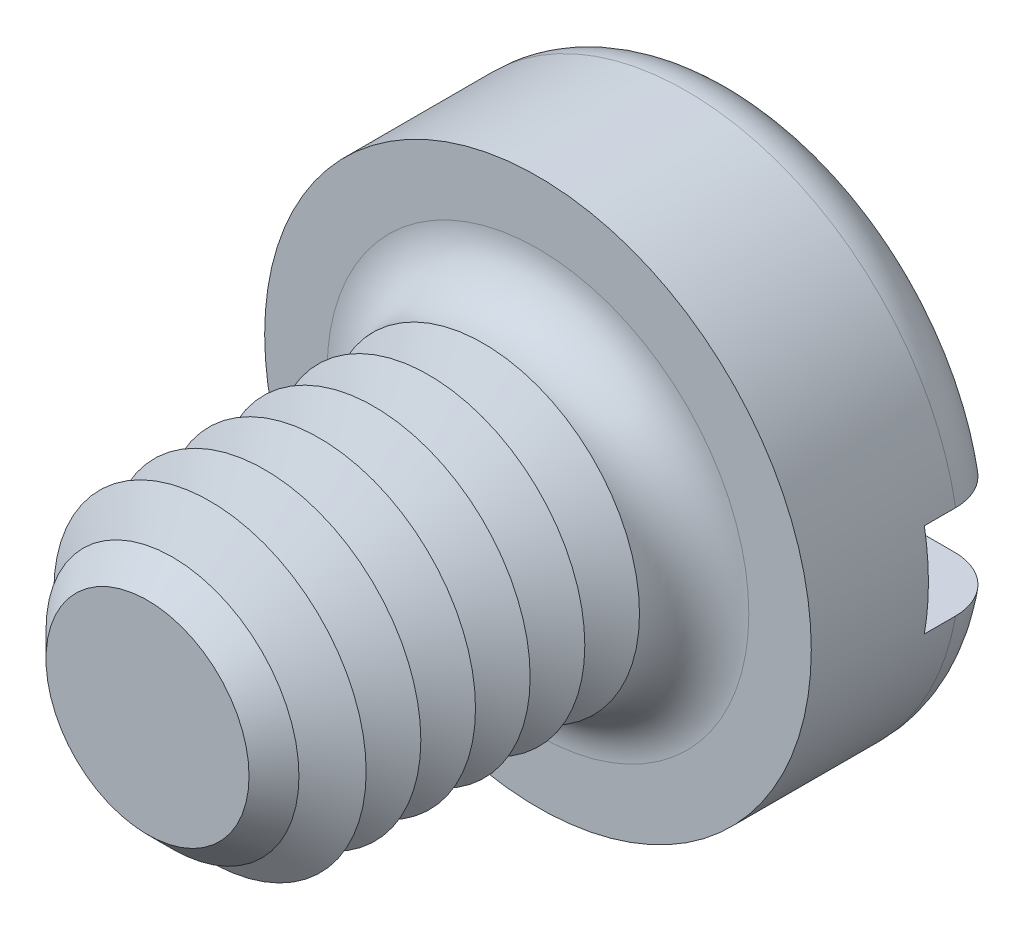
ISO-10303-21;
HEADER;
FILE_DESCRIPTION(('STEP AP214'),'2;1');
FILE_NAME('part.step','',(''),(''),'','','');
FILE_SCHEMA(('AUTOMOTIVE_DESIGN { 1 0 10303 214 1 1 1 1 }'));
ENDSEC;
DATA;
#1=APPLICATION_CONTEXT('core data for automotive mechanical design processes');
#2=APPLICATION_PROTOCOL_DEFINITION('international standard','automotive_design',2000,#1);
#3=PRODUCT_CONTEXT('',#1,'mechanical');
#4=PRODUCT('Part','Part','',(#3));
#5=PRODUCT_RELATED_PRODUCT_CATEGORY('part','',(#4));
#6=PRODUCT_DEFINITION_FORMATION('','',#4);
#7=PRODUCT_DEFINITION_CONTEXT('part definition',#1,'design');
#8=PRODUCT_DEFINITION('design','',#6,#7);
#9=PRODUCT_DEFINITION_SHAPE('','',#8);
#10=(LENGTH_UNIT() NAMED_UNIT(*) SI_UNIT(.MILLI.,.METRE.));
#11=(NAMED_UNIT(*) PLANE_ANGLE_UNIT() SI_UNIT($,.RADIAN.));
#12=(NAMED_UNIT(*) SI_UNIT($,.STERADIAN.) SOLID_ANGLE_UNIT());
#13=UNCERTAINTY_MEASURE_WITH_UNIT(LENGTH_MEASURE(1.E-05),#10,'distance_accuracy_value','');
#14=(GEOMETRIC_REPRESENTATION_CONTEXT(3) GLOBAL_UNCERTAINTY_ASSIGNED_CONTEXT((#13)) GLOBAL_UNIT_ASSIGNED_CONTEXT((#10,
#11,#12)) REPRESENTATION_CONTEXT('',''));
#15=CARTESIAN_POINT('',(0.,0.,0.));
#16=DIRECTION('',(0.,0.,1.));
#17=DIRECTION('',(1.,0.,0.));
#18=AXIS2_PLACEMENT_3D('',#15,#16,#17);
#19=CARTESIAN_POINT('',(0.,0.,-2.6));
#20=DIRECTION('',(0.,0.,1.));
#21=DIRECTION('',(1.,0.,0.));
#22=AXIS2_PLACEMENT_3D('',#19,#20,#21);
#23=PLANE('',#22);
#24=CARTESIAN_POINT('',(0.,0.,-2.6));
#25=DIRECTION('',(0.,0.,1.));
#26=DIRECTION('',(1.,0.,0.));
#27=AXIS2_PLACEMENT_3D('',#24,#25,#26);
#28=CIRCLE('',#27,2.8);
#29=CARTESIAN_POINT('',(-2.73495886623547,0.6,-2.6));
#30=VERTEX_POINT('',#29);
#31=CARTESIAN_POINT('',(2.73495886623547,0.6,-2.6));
#32=VERTEX_POINT('',#31);
#33=EDGE_CURVE('E116',#30,#32,#28,.F.);
#34=ORIENTED_EDGE('',*,*,#33,.T.);
#35=DIRECTION('',(1.,0.,0.));
#36=VECTOR('',#35,1.);
#37=CARTESIAN_POINT('',(-3.5,0.600000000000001,-2.6));
#38=LINE('',#37,#36);
#39=EDGE_CURVE('E111',#30,#32,#38,.T.);
#40=ORIENTED_EDGE('',*,*,#39,.F.);
#41=EDGE_LOOP('',(#34,#40));
#42=FACE_BOUND('',#41,.T.);
#43=ADVANCED_FACE('F39',(#42),#23,.F.);
#44=CARTESIAN_POINT('',(0.,0.,-1.9));
#45=DIRECTION('',(0.,0.,1.));
#46=DIRECTION('',(1.,0.,0.));
#47=AXIS2_PLACEMENT_3D('',#44,#45,#46);
#48=TOROIDAL_SURFACE('',#47,2.8,0.7);
#49=CARTESIAN_POINT('',(-3.24550494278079,0.600000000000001,-2.38938679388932));
#50=CARTESIAN_POINT('',(-3.21724139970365,0.600000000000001,-2.41780774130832));
#51=CARTESIAN_POINT('',(-3.18652103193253,0.600000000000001,-2.44383169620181));
#52=CARTESIAN_POINT('',(-3.12110229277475,0.600000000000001,-2.49034599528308));
#53=CARTESIAN_POINT('',(-3.08639834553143,0.6,-2.51082844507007));
#54=CARTESIAN_POINT('',(-3.01410013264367,0.6,-2.54568075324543));
#55=CARTESIAN_POINT('',(-2.97650963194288,0.6,-2.56005841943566));
#56=CARTESIAN_POINT('',(-2.89948250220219,0.6,-2.58239238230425));
#57=CARTESIAN_POINT('',(-2.86004633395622,0.6,-2.59035027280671));
#58=CARTESIAN_POINT('',(-2.77983715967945,0.6,-2.5997577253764));
#59=CARTESIAN_POINT('',(-2.73905311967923,0.6,-2.60111317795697));
#60=CARTESIAN_POINT('',(-2.65781876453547,0.6,-2.59706866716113));
#61=CARTESIAN_POINT('',(-2.61736849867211,0.6,-2.59166772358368));
#62=CARTESIAN_POINT('',(-2.53729983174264,0.6,-2.57414594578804));
#63=CARTESIAN_POINT('',(-2.49770360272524,0.6,-2.56192363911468));
#64=CARTESIAN_POINT('',(-2.421111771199,0.6,-2.5310238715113));
#65=CARTESIAN_POINT('',(-2.38411632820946,0.6,-2.51234601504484));
#66=CARTESIAN_POINT('',(-2.31371213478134,0.6,-2.46896762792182));
#67=CARTESIAN_POINT('',(-2.28031240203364,0.6,-2.44425244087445));
#68=CARTESIAN_POINT('',(-2.21823311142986,0.6,-2.38946667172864));
#69=CARTESIAN_POINT('',(-2.18955321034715,0.6,-2.35939647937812));
#70=CARTESIAN_POINT('',(-2.13836074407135,0.6,-2.29532787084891));
#71=CARTESIAN_POINT('',(-2.11574147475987,0.6,-2.26141482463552));
#72=CARTESIAN_POINT('',(-2.07677080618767,0.6,-2.19015935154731));
#73=CARTESIAN_POINT('',(-2.06041784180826,0.6,-2.15281778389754));
#74=CARTESIAN_POINT('',(-2.03508596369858,0.6,-2.07723332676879));
#75=CARTESIAN_POINT('',(-2.02585871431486,0.6,-2.03907365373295));
#76=CARTESIAN_POINT('',(-2.01416722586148,0.6,-1.96173417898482));
#77=CARTESIAN_POINT('',(-2.01170151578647,0.6,-1.92255460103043));
#78=CARTESIAN_POINT('',(-2.01359934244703,0.6,-1.84555709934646));
#79=CARTESIAN_POINT('',(-2.01775787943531,0.6,-1.80773393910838));
#80=CARTESIAN_POINT('',(-2.03236373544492,0.6,-1.73332511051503));
#81=CARTESIAN_POINT('',(-2.04281097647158,0.6,-1.69673942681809));
#82=CARTESIAN_POINT('',(-2.06962963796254,0.6,-1.62577336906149));
#83=CARTESIAN_POINT('',(-2.08600685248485,0.6,-1.59139519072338));
#84=CARTESIAN_POINT('',(-2.12413495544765,0.6,-1.52576356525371));
#85=CARTESIAN_POINT('',(-2.14588657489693,0.6,-1.49451054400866));
#86=CARTESIAN_POINT('',(-2.19483541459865,0.6,-1.43498643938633));
#87=CARTESIAN_POINT('',(-2.22217844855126,0.6,-1.40683532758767));
#88=CARTESIAN_POINT('',(-2.28105616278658,0.6,-1.35532544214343));
#89=CARTESIAN_POINT('',(-2.3125916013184,0.6,-1.33196753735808));
#90=CARTESIAN_POINT('',(-2.38018779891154,0.6,-1.28984356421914));
#91=CARTESIAN_POINT('',(-2.41637068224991,0.6,-1.27127330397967));
#92=CARTESIAN_POINT('',(-2.49129688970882,0.6,-1.24032971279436));
#93=CARTESIAN_POINT('',(-2.53004053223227,0.6,-1.22795715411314));
#94=CARTESIAN_POINT('',(-2.6098393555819,0.6,-1.2095515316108));
#95=CARTESIAN_POINT('',(-2.65092550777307,0.6,-1.20365237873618));
#96=CARTESIAN_POINT('',(-2.7335069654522,0.6,-1.1988380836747));
#97=CARTESIAN_POINT('',(-2.7750022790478,0.6,-1.19992308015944));
#98=CARTESIAN_POINT('',(-2.85718851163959,0.6,-1.20909046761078));
#99=CARTESIAN_POINT('',(-2.8978799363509,0.6,-1.21716830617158));
#100=CARTESIAN_POINT('',(-2.97729176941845,0.6,-1.24014327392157));
#101=CARTESIAN_POINT('',(-3.01601231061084,0.6,-1.25503994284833));
#102=CARTESIAN_POINT('',(-3.08976822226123,0.6,-1.29101066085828));
#103=CARTESIAN_POINT('',(-3.12484927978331,0.600000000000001,-1.31199098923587));
#104=CARTESIAN_POINT('',(-3.19090022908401,0.600000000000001,-1.35965144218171));
#105=CARTESIAN_POINT('',(-3.22187053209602,0.600000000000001,-1.38633099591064));
#106=CARTESIAN_POINT('',(-3.2781946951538,0.600000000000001,-1.44408564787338));
#107=CARTESIAN_POINT('',(-3.3036441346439,0.600000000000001,-1.47506754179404));
#108=CARTESIAN_POINT('',(-3.34887649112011,0.600000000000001,-1.54092398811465));
#109=CARTESIAN_POINT('',(-3.36865993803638,0.600000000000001,-1.57579817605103));
#110=CARTESIAN_POINT('',(-3.40166738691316,0.600000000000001,-1.64783067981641));
#111=CARTESIAN_POINT('',(-3.41499360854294,0.600000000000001,-1.68494217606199));
#112=CARTESIAN_POINT('',(-3.43515375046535,0.600000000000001,-1.76088675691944));
#113=CARTESIAN_POINT('',(-3.44198836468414,0.600000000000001,-1.79971965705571));
#114=CARTESIAN_POINT('',(-3.44891916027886,0.600000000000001,-1.87757893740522));
#115=CARTESIAN_POINT('',(-3.44908375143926,0.600000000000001,-1.91659924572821));
#116=CARTESIAN_POINT('',(-3.44284111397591,0.600000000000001,-1.99412088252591));
#117=CARTESIAN_POINT('',(-3.43643236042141,0.600000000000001,-2.03262208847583));
#118=CARTESIAN_POINT('',(-3.41725803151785,0.600000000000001,-2.10792315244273));
#119=CARTESIAN_POINT('',(-3.40450469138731,0.600000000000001,-2.14472613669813));
#120=CARTESIAN_POINT('',(-3.3730385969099,0.600000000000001,-2.21565060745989));
#121=CARTESIAN_POINT('',(-3.35433321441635,0.600000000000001,-2.24977534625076));
#122=CARTESIAN_POINT('',(-3.3201892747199,0.600000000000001,-2.30136364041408));
#123=CARTESIAN_POINT('',(-3.30647805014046,0.600000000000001,-2.31999402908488));
#124=CARTESIAN_POINT('',(-3.27728518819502,0.600000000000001,-2.35581090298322));
#125=CARTESIAN_POINT('',(-3.26180356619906,0.600000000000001,-2.37299740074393));
#126=CARTESIAN_POINT('',(-3.24550494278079,0.600000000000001,-2.38938679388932));
#127=B_SPLINE_CURVE_WITH_KNOTS('',3,(#49,#50,#51,#52,#53,#54,#55,#56,#57,#58,#59,#60,#61,#62,
#63,#64,#65,#66,#67,#68,#69,#70,#71,#72,#73,#74,#75,#76,#77,#78,#79,#80,#81,#82,#83,#84,#85,#86,
#87,#88,#89,#90,#91,#92,#93,#94,#95,#96,#97,#98,#99,#100,#101,#102,#103,#104,#105,#106,#107,
#108,#109,#110,#111,#112,#113,#114,#115,#116,#117,#118,#119,#120,#121,#122,#123,#124,#125,#126),
.UNSPECIFIED.,.T.,.F.,(4,2,2,2,2,2,2,2,2,2,2,2,2,2,2,2,2,2,2,2,2,2,2,2,2,2,2,2,2,2,2,2,2,2,2,2,
2,2,4),(0.,0.120160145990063,0.240490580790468,0.36066665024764,0.480812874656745,
0.602666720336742,0.724538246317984,0.848272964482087,0.972015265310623,1.09606100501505,
1.2200977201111,1.34178071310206,1.46343329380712,1.58062647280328,1.6977941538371,
1.81140573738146,1.92501591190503,2.03873739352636,2.15247435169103,2.26967910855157,
2.38690509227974,2.50835551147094,2.62982106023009,2.75375450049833,2.87769040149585,
3.00154567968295,3.12539259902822,3.24742469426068,3.36944457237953,3.48914477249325,
3.60883377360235,3.72656056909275,3.84427477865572,3.96078136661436,4.07731498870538,
4.19362474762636,4.3097910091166,4.37908387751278,4.44837614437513),.UNSPECIFIED.);
#128=CARTESIAN_POINT('',(-3.44818792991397,0.600000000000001,-1.8999999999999));
#129=VERTEX_POINT('',#128);
#130=EDGE_CURVE('E232',#129,#30,#127,.T.);
#131=ORIENTED_EDGE('',*,*,#130,.F.);
#132=CARTESIAN_POINT('',(0.,0.,-1.9));
#133=DIRECTION('',(0.,0.,1.));
#134=DIRECTION('',(1.,0.,0.));
#135=AXIS2_PLACEMENT_3D('',#132,#133,#134);
#136=CIRCLE('',#135,3.5);
#137=CARTESIAN_POINT('',(3.44818792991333,0.6,-1.9));
#138=VERTEX_POINT('',#137);
#139=EDGE_CURVE('E125',#138,#129,#136,.T.);
#140=ORIENTED_EDGE('',*,*,#139,.F.);
#141=CARTESIAN_POINT('',(2.1414268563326,0.6,-2.29762171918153));
#142=CARTESIAN_POINT('',(2.16505443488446,0.6,-2.33058245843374));
#143=CARTESIAN_POINT('',(2.19155609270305,0.6,-2.36152717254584));
#144=CARTESIAN_POINT('',(2.24942944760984,0.6,-2.41852964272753));
#145=CARTESIAN_POINT('',(2.28080921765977,0.6,-2.44457913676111));
#146=CARTESIAN_POINT('',(2.34741203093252,0.6,-2.49105381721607));
#147=CARTESIAN_POINT('',(2.38262862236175,0.6,-2.51148824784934));
#148=CARTESIAN_POINT('',(2.45593176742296,0.6,-2.54626881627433));
#149=CARTESIAN_POINT('',(2.49401741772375,0.6,-2.56061686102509));
#150=CARTESIAN_POINT('',(2.57272605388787,0.6,-2.58306429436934));
#151=CARTESIAN_POINT('',(2.6133821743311,0.6,-2.59104769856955));
#152=CARTESIAN_POINT('',(2.6954618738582,0.6,-2.60009608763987));
#153=CARTESIAN_POINT('',(2.73688552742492,0.6,-2.60116039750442));
#154=CARTESIAN_POINT('',(2.81941950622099,0.6,-2.5962925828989));
#155=CARTESIAN_POINT('',(2.86052888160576,0.6,-2.59034422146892));
#156=CARTESIAN_POINT('',(2.94113709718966,0.6,-2.57153687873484));
#157=CARTESIAN_POINT('',(2.98063603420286,0.6,-2.55867831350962));
#158=CARTESIAN_POINT('',(3.05633735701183,0.6,-2.52657771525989));
#159=CARTESIAN_POINT('',(3.09257627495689,0.6,-2.50742188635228));
#160=CARTESIAN_POINT('',(3.16123898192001,0.6,-2.46318606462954));
#161=CARTESIAN_POINT('',(3.19366316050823,0.6,-2.4381066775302));
#162=CARTESIAN_POINT('',(3.25312278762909,0.6,-2.38324481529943));
#163=CARTESIAN_POINT('',(3.28024842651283,0.6,-2.35356008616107));
#164=CARTESIAN_POINT('',(3.32902587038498,0.6,-2.28998971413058));
#165=CARTESIAN_POINT('',(3.35067820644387,0.6,-2.25610447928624));
#166=CARTESIAN_POINT('',(3.38751207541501,0.6,-2.18572286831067));
#167=CARTESIAN_POINT('',(3.40279804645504,0.6,-2.14928112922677));
#168=CARTESIAN_POINT('',(3.42695590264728,0.6,-2.07433042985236));
#169=CARTESIAN_POINT('',(3.43582824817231,0.6,-2.03582161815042));
#170=CARTESIAN_POINT('',(3.44682113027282,0.6,-1.95829536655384));
#171=CARTESIAN_POINT('',(3.44901648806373,0.6,-1.91928851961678));
#172=CARTESIAN_POINT('',(3.44680085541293,0.6,-1.84146366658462));
#173=CARTESIAN_POINT('',(3.44239008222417,0.6,-1.80264565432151));
#174=CARTESIAN_POINT('',(3.42712544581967,0.6,-1.72644634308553));
#175=CARTESIAN_POINT('',(3.41629508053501,0.6,-1.6890603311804));
#176=CARTESIAN_POINT('',(3.38853757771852,0.6,-1.61662604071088));
#177=CARTESIAN_POINT('',(3.37161039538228,0.6,-1.58157777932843));
#178=CARTESIAN_POINT('',(3.33207798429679,0.6,-1.51464178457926));
#179=CARTESIAN_POINT('',(3.30944854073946,0.6,-1.48276835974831));
#180=CARTESIAN_POINT('',(3.2592165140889,0.6,-1.42321861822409));
#181=CARTESIAN_POINT('',(3.23161370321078,0.6,-1.3955424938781));
#182=CARTESIAN_POINT('',(3.17188519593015,0.6,-1.34481834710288));
#183=CARTESIAN_POINT('',(3.13971065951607,0.6,-1.32182785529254));
#184=CARTESIAN_POINT('',(3.07201123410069,0.6,-1.28147003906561));
#185=CARTESIAN_POINT('',(3.03648608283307,0.6,-1.26410315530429));
#186=CARTESIAN_POINT('',(2.962449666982,0.6,-1.2351645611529));
#187=CARTESIAN_POINT('',(2.92389781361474,0.6,-1.22369671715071));
#188=CARTESIAN_POINT('',(2.84543273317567,0.6,-1.20726565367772));
#189=CARTESIAN_POINT('',(2.80551936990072,0.6,-1.20230308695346));
#190=CARTESIAN_POINT('',(2.72467191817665,0.6,-1.1989357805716));
#191=CARTESIAN_POINT('',(2.68373266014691,0.6,-1.20065484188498));
#192=CARTESIAN_POINT('',(2.60270222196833,0.6,-1.21084560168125));
#193=CARTESIAN_POINT('',(2.56261112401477,0.6,-1.21931795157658));
#194=CARTESIAN_POINT('',(2.48385954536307,0.6,-1.24292934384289));
#195=CARTESIAN_POINT('',(2.44522508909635,0.6,-1.25815531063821));
#196=CARTESIAN_POINT('',(2.37106165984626,0.6,-1.29488663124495));
#197=CARTESIAN_POINT('',(2.33553282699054,0.6,-1.31639226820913));
#198=CARTESIAN_POINT('',(2.2686996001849,0.6,-1.36507949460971));
#199=CARTESIAN_POINT('',(2.23738745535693,0.6,-1.39225042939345));
#200=CARTESIAN_POINT('',(2.17990424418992,0.6,-1.45157941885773));
#201=CARTESIAN_POINT('',(2.15373259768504,0.6,-1.48373691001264));
#202=CARTESIAN_POINT('',(2.10799355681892,0.6,-1.551327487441));
#203=CARTESIAN_POINT('',(2.08828258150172,0.6,-1.58666329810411));
#204=CARTESIAN_POINT('',(2.05534440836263,0.6,-1.66023600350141));
#205=CARTESIAN_POINT('',(2.042115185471,0.6,-1.6984719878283));
#206=CARTESIAN_POINT('',(2.02303126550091,0.6,-1.77519783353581));
#207=CARTESIAN_POINT('',(2.01691541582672,0.6,-1.8136228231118));
#208=CARTESIAN_POINT('',(2.01140375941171,0.6,-1.89096056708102));
#209=CARTESIAN_POINT('',(2.01200856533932,0.6,-1.92987336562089));
#210=CARTESIAN_POINT('',(2.01981617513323,0.6,-2.006065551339));
#211=CARTESIAN_POINT('',(2.02685835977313,0.6,-2.04336165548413));
#212=CARTESIAN_POINT('',(2.0470502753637,0.6,-2.1162250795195));
#213=CARTESIAN_POINT('',(2.06019252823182,0.6,-2.15179445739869));
#214=CARTESIAN_POINT('',(2.08525738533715,0.6,-2.20558874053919));
#215=CARTESIAN_POINT('',(2.09529161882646,0.6,-2.22471751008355));
#216=CARTESIAN_POINT('',(2.11708813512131,0.6,-2.26196179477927));
#217=CARTESIAN_POINT('',(2.12885034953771,0.6,-2.28007734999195));
#218=CARTESIAN_POINT('',(2.1414268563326,0.6,-2.29762171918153));
#219=B_SPLINE_CURVE_WITH_KNOTS('',3,(#141,#142,#143,#144,#145,#146,#147,#148,#149,#150,#151,
#152,#153,#154,#155,#156,#157,#158,#159,#160,#161,#162,#163,#164,#165,#166,#167,#168,#169,#170,
#171,#172,#173,#174,#175,#176,#177,#178,#179,#180,#181,#182,#183,#184,#185,#186,#187,#188,#189,
#190,#191,#192,#193,#194,#195,#196,#197,#198,#199,#200,#201,#202,#203,#204,#205,#206,#207,#208,
#209,#210,#211,#212,#213,#214,#215,#216,#217,#218),.UNSPECIFIED.,.T.,.F.,(4,2,2,2,2,2,2,2,2,2,2,
2,2,2,2,2,2,2,2,2,2,2,2,2,2,2,2,2,2,2,2,2,2,2,2,2,2,2,4),(0.,0.121582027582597,
0.243367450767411,0.364951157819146,0.486496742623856,0.610209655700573,0.733934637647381,
0.857946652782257,0.981951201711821,1.1043243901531,1.22668507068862,1.34673532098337,
1.46677391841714,1.58475736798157,1.70273234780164,1.81938035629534,1.93602452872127,
2.05224435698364,2.168465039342,2.28518782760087,2.40191596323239,2.52000081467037,
2.63809491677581,2.75820270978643,2.87832255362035,3.00067856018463,3.1230463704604,
3.24703703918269,3.37103329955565,3.49479843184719,3.6185495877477,3.73932715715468,
3.86006696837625,3.9762182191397,4.09238005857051,4.2057203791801,4.31892212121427,
4.38364046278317,4.44835624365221),.UNSPECIFIED.);
#220=EDGE_CURVE('E234',#32,#138,#219,.T.);
#221=ORIENTED_EDGE('',*,*,#220,.F.);
#222=ORIENTED_EDGE('',*,*,#33,.F.);
#223=EDGE_LOOP('',(#131,#140,#221,#222));
#224=FACE_BOUND('',#223,.T.);
#225=ADVANCED_FACE('F216',(#224),#48,.T.);
#226=CARTESIAN_POINT('',(0.,0.,-2.6));
#227=DIRECTION('',(0.,0.,1.));
#228=DIRECTION('',(1.,0.,0.));
#229=AXIS2_PLACEMENT_3D('',#226,#227,#228);
#230=CYLINDRICAL_SURFACE('',#229,3.5);
#231=DIRECTION('',(0.,0.,1.));
#232=VECTOR('',#231,1.);
#233=CARTESIAN_POINT('',(3.44818792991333,0.6,-2.6));
#234=LINE('',#233,#232);
#235=CARTESIAN_POINT('',(3.44818792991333,0.6,-1.5));
#236=VERTEX_POINT('',#235);
#237=EDGE_CURVE('E249',#138,#236,#234,.T.);
#238=ORIENTED_EDGE('',*,*,#237,.F.);
#239=ORIENTED_EDGE('',*,*,#139,.T.);
#240=DIRECTION('',(0.,0.,1.));
#241=VECTOR('',#240,1.);
#242=CARTESIAN_POINT('',(-3.44818792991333,0.600000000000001,-2.6));
#243=LINE('',#242,#241);
#244=CARTESIAN_POINT('',(-3.44818792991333,0.600000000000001,-1.5));
#245=VERTEX_POINT('',#244);
#246=EDGE_CURVE('E63',#245,#129,#243,.F.);
#247=ORIENTED_EDGE('',*,*,#246,.F.);
#248=CARTESIAN_POINT('',(0.,0.,-1.5));
#249=DIRECTION('',(0.,0.,-1.));
#250=DIRECTION('',(-1.,0.,0.));
#251=AXIS2_PLACEMENT_3D('',#248,#249,#250);
#252=CIRCLE('',#251,3.5);
#253=CARTESIAN_POINT('',(-3.44818792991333,-0.599999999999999,-1.5));
#254=VERTEX_POINT('',#253);
#255=EDGE_CURVE('E43',#245,#254,#252,.F.);
#256=ORIENTED_EDGE('',*,*,#255,.T.);
#257=DIRECTION('',(0.,0.,1.));
#258=VECTOR('',#257,1.);
#259=CARTESIAN_POINT('',(-3.44818792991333,-0.599999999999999,-2.6));
#260=LINE('',#259,#258);
#261=CARTESIAN_POINT('',(-3.44818792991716,-0.599999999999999,-1.90000000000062));
#262=VERTEX_POINT('',#261);
#263=EDGE_CURVE('E246',#262,#254,#260,.T.);
#264=ORIENTED_EDGE('',*,*,#263,.F.);
#265=CARTESIAN_POINT('',(3.44818792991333,-0.6,-1.9));
#266=VERTEX_POINT('',#265);
#267=EDGE_CURVE('E127',#262,#266,#136,.T.);
#268=ORIENTED_EDGE('',*,*,#267,.T.);
#269=DIRECTION('',(0.,0.,1.));
#270=VECTOR('',#269,1.);
#271=CARTESIAN_POINT('',(3.44818792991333,-0.6,-2.6));
#272=LINE('',#271,#270);
#273=CARTESIAN_POINT('',(3.44818792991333,-0.6,-1.5));
#274=VERTEX_POINT('',#273);
#275=EDGE_CURVE('E55',#274,#266,#272,.F.);
#276=ORIENTED_EDGE('',*,*,#275,.F.);
#277=EDGE_CURVE('E11',#274,#236,#252,.F.);
#278=ORIENTED_EDGE('',*,*,#277,.T.);
#279=EDGE_LOOP('',(#238,#239,#247,#256,#264,#268,#276,#278));
#280=FACE_BOUND('',#279,.T.);
#281=CARTESIAN_POINT('',(0.,0.,0.));
#282=DIRECTION('',(0.,0.,1.));
#283=DIRECTION('',(1.,0.,0.));
#284=AXIS2_PLACEMENT_3D('',#281,#282,#283);
#285=CIRCLE('',#284,3.5);
#286=CARTESIAN_POINT('',(3.5,0.,0.));
#287=VERTEX_POINT('',#286);
#288=EDGE_CURVE('E252',#287,#287,#285,.T.);
#289=ORIENTED_EDGE('',*,*,#288,.F.);
#290=EDGE_LOOP('',(#289));
#291=FACE_BOUND('',#290,.T.);
#292=ADVANCED_FACE('F212',(#280,#291),#230,.T.);
#293=CARTESIAN_POINT('',(2.73495886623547,-0.6,-2.6));
#294=VERTEX_POINT('',#293);
#295=CARTESIAN_POINT('',(-2.73495886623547,-0.6,-2.6));
#296=VERTEX_POINT('',#295);
#297=EDGE_CURVE('E109',#294,#296,#28,.F.);
#298=ORIENTED_EDGE('',*,*,#297,.T.);
#299=DIRECTION('',(-1.,0.,0.));
#300=VECTOR('',#299,1.);
#301=CARTESIAN_POINT('',(-3.5,-0.599999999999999,-2.6));
#302=LINE('',#301,#300);
#303=EDGE_CURVE('E96',#294,#296,#302,.T.);
#304=ORIENTED_EDGE('',*,*,#303,.F.);
#305=EDGE_LOOP('',(#298,#304));
#306=FACE_BOUND('',#305,.T.);
#307=ADVANCED_FACE('F108',(#306),#23,.F.);
#308=CARTESIAN_POINT('',(0.,0.,0.));
#309=DIRECTION('',(0.,0.,1.));
#310=DIRECTION('',(1.,0.,0.));
#311=AXIS2_PLACEMENT_3D('',#308,#309,#310);
#312=PLANE('',#311);
#313=CARTESIAN_POINT('',(0.,0.,0.));
#314=DIRECTION('',(0.,0.,1.));
#315=DIRECTION('',(1.,0.,0.));
#316=AXIS2_PLACEMENT_3D('',#313,#314,#315);
#317=CIRCLE('',#316,2.7);
#318=CARTESIAN_POINT('',(2.7,0.,0.));
#319=VERTEX_POINT('',#318);
#320=EDGE_CURVE('E115',#319,#319,#317,.F.);
#321=ORIENTED_EDGE('',*,*,#320,.T.);
#322=EDGE_LOOP('',(#321));
#323=FACE_BOUND('',#322,.T.);
#324=ORIENTED_EDGE('',*,*,#288,.T.);
#325=EDGE_LOOP('',(#324));
#326=FACE_BOUND('',#325,.T.);
#327=ADVANCED_FACE('F211',(#323,#326),#312,.T.);
#328=CARTESIAN_POINT('',(-3.24550494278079,-0.599999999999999,-2.38938679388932));
#329=CARTESIAN_POINT('',(-3.27309693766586,-0.599999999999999,-2.36163611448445));
#330=CARTESIAN_POINT('',(-3.29838741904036,-0.599999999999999,-2.3315608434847));
#331=CARTESIAN_POINT('',(-3.34359429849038,-0.599999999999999,-2.26757659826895));
#332=CARTESIAN_POINT('',(-3.36350518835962,-0.599999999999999,-2.23366374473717));
#333=CARTESIAN_POINT('',(-3.39733065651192,-0.599999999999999,-2.16296274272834));
#334=CARTESIAN_POINT('',(-3.4112451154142,-0.599999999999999,-2.12617453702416));
#335=CARTESIAN_POINT('',(-3.43264462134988,-0.599999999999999,-2.05078178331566));
#336=CARTESIAN_POINT('',(-3.44013114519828,-0.599999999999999,-2.01217765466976));
#337=CARTESIAN_POINT('',(-3.44841975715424,-0.599999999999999,-1.9345391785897));
#338=CARTESIAN_POINT('',(-3.44926944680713,-0.599999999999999,-1.89550990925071));
#339=CARTESIAN_POINT('',(-3.44438358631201,-0.599999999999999,-1.81786552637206));
#340=CARTESIAN_POINT('',(-3.43864801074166,-0.599999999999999,-1.77925041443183));
#341=CARTESIAN_POINT('',(-3.42079221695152,-0.599999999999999,-1.70364264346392));
#342=CARTESIAN_POINT('',(-3.40869011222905,-0.599999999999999,-1.66664570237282));
#343=CARTESIAN_POINT('',(-3.37847692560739,-0.599999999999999,-1.59519424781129));
#344=CARTESIAN_POINT('',(-3.3603657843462,-0.599999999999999,-1.56073975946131));
#345=CARTESIAN_POINT('',(-3.31856549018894,-0.599999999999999,-1.4951524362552));
#346=CARTESIAN_POINT('',(-3.29484830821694,-0.599999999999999,-1.46403747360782));
#347=CARTESIAN_POINT('',(-3.24258489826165,-0.599999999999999,-1.40617131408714));
#348=CARTESIAN_POINT('',(-3.21403843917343,-0.599999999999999,-1.37942032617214));
#349=CARTESIAN_POINT('',(-3.15256084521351,-0.599999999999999,-1.33067963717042));
#350=CARTESIAN_POINT('',(-3.11958015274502,-0.599999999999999,-1.30875246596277));
#351=CARTESIAN_POINT('',(-3.0504559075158,-0.599999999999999,-1.27063718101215));
#352=CARTESIAN_POINT('',(-3.01431209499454,-0.6,-1.25444953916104));
#353=CARTESIAN_POINT('',(-2.93921710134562,-0.6,-1.22796796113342));
#354=CARTESIAN_POINT('',(-2.90022796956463,-0.6,-1.217781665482));
#355=CARTESIAN_POINT('',(-2.82110512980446,-0.6,-1.20396915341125));
#356=CARTESIAN_POINT('',(-2.7809713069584,-0.6,-1.2003435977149));
#357=CARTESIAN_POINT('',(-2.69990924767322,-0.6,-1.19969717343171));
#358=CARTESIAN_POINT('',(-2.65898001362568,-0.6,-1.20279937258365));
#359=CARTESIAN_POINT('',(-2.57819986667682,-0.6,-1.21574287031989));
#360=CARTESIAN_POINT('',(-2.53834905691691,-0.6,-1.22558481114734));
#361=CARTESIAN_POINT('',(-2.46035232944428,-0.6,-1.25189361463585));
#362=CARTESIAN_POINT('',(-2.42223314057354,-0.6,-1.2684398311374));
#363=CARTESIAN_POINT('',(-2.34932316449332,-0.6,-1.30771928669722));
#364=CARTESIAN_POINT('',(-2.31453248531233,-0.6,-1.33045272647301));
#365=CARTESIAN_POINT('',(-2.24945577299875,-0.6,-1.38141543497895));
#366=CARTESIAN_POINT('',(-2.21915255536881,-0.6,-1.40962272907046));
#367=CARTESIAN_POINT('',(-2.16386461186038,-0.6,-1.47084552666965));
#368=CARTESIAN_POINT('',(-2.13887916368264,-0.6,-1.50386037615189));
#369=CARTESIAN_POINT('',(-2.09568071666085,-0.6,-1.57285917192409));
#370=CARTESIAN_POINT('',(-2.07730739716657,-0.6,-1.60874263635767));
#371=CARTESIAN_POINT('',(-2.04712019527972,-0.6,-1.68316975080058));
#372=CARTESIAN_POINT('',(-2.03530452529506,-0.6,-1.72171267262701));
#373=CARTESIAN_POINT('',(-2.01901751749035,-0.6,-1.79878952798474));
#374=CARTESIAN_POINT('',(-2.01428434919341,-0.6,-1.8372682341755));
#375=CARTESIAN_POINT('',(-2.01150652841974,-0.6,-1.91446369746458));
#376=CARTESIAN_POINT('',(-2.01346084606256,-0.6,-1.95318041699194));
#377=CARTESIAN_POINT('',(-2.02386268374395,-0.6,-2.0288619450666));
#378=CARTESIAN_POINT('',(-2.03216724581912,-0.6,-2.06584654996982));
#379=CARTESIAN_POINT('',(-2.05479337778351,-0.6,-2.13792373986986));
#380=CARTESIAN_POINT('',(-2.06911522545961,-0.6,-2.1730162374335));
#381=CARTESIAN_POINT('',(-2.10349906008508,-0.6,-2.24081034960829));
#382=CARTESIAN_POINT('',(-2.12363007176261,-0.6,-2.27347689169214));
#383=CARTESIAN_POINT('',(-2.16891308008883,-0.6,-2.33511902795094));
#384=CARTESIAN_POINT('',(-2.19406590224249,-0.6,-2.36409401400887));
#385=CARTESIAN_POINT('',(-2.24962389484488,-0.6,-2.41861972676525));
#386=CARTESIAN_POINT('',(-2.28018314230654,-0.6,-2.44401345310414));
#387=CARTESIAN_POINT('',(-2.34501720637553,-0.6,-2.48950558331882));
#388=CARTESIAN_POINT('',(-2.37929266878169,-0.6,-2.50960306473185));
#389=CARTESIAN_POINT('',(-2.45179417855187,-0.6,-2.54458276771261));
#390=CARTESIAN_POINT('',(-2.49011248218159,-0.6,-2.55927401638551));
#391=CARTESIAN_POINT('',(-2.56865227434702,-0.6,-2.58211133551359));
#392=CARTESIAN_POINT('',(-2.60887386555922,-0.6,-2.59025705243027));
#393=CARTESIAN_POINT('',(-2.69064746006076,-0.6,-2.59982905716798));
#394=CARTESIAN_POINT('',(-2.73220999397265,-0.6,-2.60116580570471));
#395=CARTESIAN_POINT('',(-2.81497658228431,-0.6,-2.59679700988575));
#396=CARTESIAN_POINT('',(-2.85618055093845,-0.6,-2.59108982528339));
#397=CARTESIAN_POINT('',(-2.93677683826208,-0.6,-2.57279487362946));
#398=CARTESIAN_POINT('',(-2.97617834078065,-0.6,-2.56024753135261));
#399=CARTESIAN_POINT('',(-3.05222242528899,-0.6,-2.52860709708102));
#400=CARTESIAN_POINT('',(-3.08886850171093,-0.599999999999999,-2.50952247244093));
#401=CARTESIAN_POINT('',(-3.14562501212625,-0.599999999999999,-2.47340693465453));
#402=CARTESIAN_POINT('',(-3.16689358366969,-0.599999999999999,-2.45816337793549));
#403=CARTESIAN_POINT('',(-3.20761866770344,-0.599999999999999,-2.42542115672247));
#404=CARTESIAN_POINT('',(-3.22707520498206,-0.599999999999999,-2.40792252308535));
#405=CARTESIAN_POINT('',(-3.24550494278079,-0.599999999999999,-2.38938679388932));
#406=B_SPLINE_CURVE_WITH_KNOTS('',3,(#328,#329,#330,#331,#332,#333,#334,#335,#336,#337,#338,
#339,#340,#341,#342,#343,#344,#345,#346,#347,#348,#349,#350,#351,#352,#353,#354,#355,#356,#357,
#358,#359,#360,#361,#362,#363,#364,#365,#366,#367,#368,#369,#370,#371,#372,#373,#374,#375,#376,
#377,#378,#379,#380,#381,#382,#383,#384,#385,#386,#387,#388,#389,#390,#391,#392,#393,#394,#395,
#396,#397,#398,#399,#400,#401,#402,#403,#404,#405),.UNSPECIFIED.,.T.,.F.,(4,2,2,2,2,2,2,2,2,2,2,
2,2,2,2,2,2,2,2,2,2,2,2,2,2,2,2,2,2,2,2,2,2,2,2,2,2,2,4),(0.,0.117306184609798,
0.234732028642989,0.352160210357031,0.469561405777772,0.586119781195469,0.702678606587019,
0.818907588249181,0.935137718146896,1.05196174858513,1.1687913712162,1.2870562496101,
1.40533084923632,1.52566688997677,1.64601504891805,1.76858322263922,1.89116307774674,
2.01523830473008,2.13931755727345,2.26290863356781,2.38648291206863,2.50681878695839,
2.62712184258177,2.74285697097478,2.85857427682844,2.97176054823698,3.08495204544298,
3.19954814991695,3.31416310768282,3.43282436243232,3.55150627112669,3.67404987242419,
3.79660009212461,3.92075778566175,4.04494439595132,4.16840490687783,4.29170610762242,
4.3700604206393,4.44841366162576),.UNSPECIFIED.);
#407=EDGE_CURVE('E103',#296,#262,#406,.T.);
#408=ORIENTED_EDGE('',*,*,#407,.F.);
#409=ORIENTED_EDGE('',*,*,#297,.F.);
#410=CARTESIAN_POINT('',(2.1414268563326,-0.6,-2.29762171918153));
#411=CARTESIAN_POINT('',(2.11900044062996,-0.6,-2.26633119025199));
#412=CARTESIAN_POINT('',(2.09913154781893,-0.6,-2.23318080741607));
#413=CARTESIAN_POINT('',(2.06517900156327,-0.6,-2.16401111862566));
#414=CARTESIAN_POINT('',(2.05109968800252,-0.6,-2.12798968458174));
#415=CARTESIAN_POINT('',(2.02923593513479,-0.6,-2.05404277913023));
#416=CARTESIAN_POINT('',(2.02145692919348,-0.6,-2.01611569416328));
#417=CARTESIAN_POINT('',(2.01251710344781,-0.6,-1.93949649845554));
#418=CARTESIAN_POINT('',(2.01135461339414,-0.6,-1.90080458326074));
#419=CARTESIAN_POINT('',(2.01564803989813,-0.6,-1.82450508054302));
#420=CARTESIAN_POINT('',(2.02098305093,-0.6,-1.78689061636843));
#421=CARTESIAN_POINT('',(2.03786826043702,-0.6,-1.71308589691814));
#422=CARTESIAN_POINT('',(2.04941870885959,-0.6,-1.67689569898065));
#423=CARTESIAN_POINT('',(2.07838664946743,-0.6,-1.60676639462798));
#424=CARTESIAN_POINT('',(2.09582944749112,-0.6,-1.57283776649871));
#425=CARTESIAN_POINT('',(2.1359925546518,-0.6,-1.50826612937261));
#426=CARTESIAN_POINT('',(2.15871360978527,-0.6,-1.47762358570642));
#427=CARTESIAN_POINT('',(2.20955413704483,-0.6,-1.41943384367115));
#428=CARTESIAN_POINT('',(2.23782364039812,-0.6,-1.39201777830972));
#429=CARTESIAN_POINT('',(2.29842612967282,-0.6,-1.34212199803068));
#430=CARTESIAN_POINT('',(2.33075984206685,-0.6,-1.31964316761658));
#431=CARTESIAN_POINT('',(2.399806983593,-0.6,-1.27945238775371));
#432=CARTESIAN_POINT('',(2.43663466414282,-0.6,-1.26193653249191));
#433=CARTESIAN_POINT('',(2.51267241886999,-0.6,-1.23320660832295));
#434=CARTESIAN_POINT('',(2.55188277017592,-0.6,-1.22199327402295));
#435=CARTESIAN_POINT('',(2.63235000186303,-0.6,-1.20602688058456));
#436=CARTESIAN_POINT('',(2.673631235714,-0.6,-1.20139617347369));
#437=CARTESIAN_POINT('',(2.7563863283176,-0.6,-1.19914622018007));
#438=CARTESIAN_POINT('',(2.79786018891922,-0.6,-1.20152704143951));
#439=CARTESIAN_POINT('',(2.87971192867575,-0.6,-1.21326884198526));
#440=CARTESIAN_POINT('',(2.92009214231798,-0.6,-1.22261349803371));
#441=CARTESIAN_POINT('',(2.99866777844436,-0.6,-1.24805614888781));
#442=CARTESIAN_POINT('',(3.03686335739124,-0.6,-1.26415365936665));
#443=CARTESIAN_POINT('',(3.10934738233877,-0.6,-1.3023912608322));
#444=CARTESIAN_POINT('',(3.14368704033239,-0.6,-1.32443423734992));
#445=CARTESIAN_POINT('',(3.20808395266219,-0.6,-1.37407725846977));
#446=CARTESIAN_POINT('',(3.23814164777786,-0.6,-1.40167673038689));
#447=CARTESIAN_POINT('',(3.29251534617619,-0.6,-1.46108303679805));
#448=CARTESIAN_POINT('',(3.3169296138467,-0.6,-1.49279994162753));
#449=CARTESIAN_POINT('',(3.35998418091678,-0.6,-1.55993706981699));
#450=CARTESIAN_POINT('',(3.37862502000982,-0.6,-1.59535694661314));
#451=CARTESIAN_POINT('',(3.40930212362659,-0.6,-1.668283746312));
#452=CARTESIAN_POINT('',(3.42143897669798,-0.6,-1.70574837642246));
#453=CARTESIAN_POINT('',(3.43918305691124,-0.6,-1.78219297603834));
#454=CARTESIAN_POINT('',(3.44479069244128,-0.6,-1.82117285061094));
#455=CARTESIAN_POINT('',(3.44928173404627,-0.6,-1.89914596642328));
#456=CARTESIAN_POINT('',(3.44822835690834,-0.6,-1.93813558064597));
#457=CARTESIAN_POINT('',(3.43957811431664,-0.6,-2.0153811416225));
#458=CARTESIAN_POINT('',(3.43198139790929,-0.6,-2.05363710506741));
#459=CARTESIAN_POINT('',(3.41049386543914,-0.6,-2.12826741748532));
#460=CARTESIAN_POINT('',(3.39661362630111,-0.6,-2.16464481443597));
#461=CARTESIAN_POINT('',(3.36297924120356,-0.6,-2.23457274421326));
#462=CARTESIAN_POINT('',(3.34322499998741,-0.6,-2.26812323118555));
#463=CARTESIAN_POINT('',(3.29828706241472,-0.6,-2.33167864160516));
#464=CARTESIAN_POINT('',(3.27307040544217,-0.6,-2.36166024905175));
#465=CARTESIAN_POINT('',(3.21802069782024,-0.6,-2.41703165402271));
#466=CARTESIAN_POINT('',(3.18818738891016,-0.6,-2.44242119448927));
#467=CARTESIAN_POINT('',(3.12433871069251,-0.6,-2.48825551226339));
#468=CARTESIAN_POINT('',(3.09027338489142,-0.6,-2.50863067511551));
#469=CARTESIAN_POINT('',(3.01925175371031,-0.6,-2.54348754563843));
#470=CARTESIAN_POINT('',(2.982295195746,-0.6,-2.55796873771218));
#471=CARTESIAN_POINT('',(2.90583499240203,-0.6,-2.58090526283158));
#472=CARTESIAN_POINT('',(2.86629758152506,-0.6,-2.58924801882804));
#473=CARTESIAN_POINT('',(2.78639041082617,-0.6,-2.59930573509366));
#474=CARTESIAN_POINT('',(2.7460205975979,-0.6,-2.60102026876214));
#475=CARTESIAN_POINT('',(2.66482039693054,-0.6,-2.59779078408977));
#476=CARTESIAN_POINT('',(2.62399477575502,-0.6,-2.59272651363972));
#477=CARTESIAN_POINT('',(2.54373809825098,-0.6,-2.57588976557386));
#478=CARTESIAN_POINT('',(2.50430750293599,-0.6,-2.56411509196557));
#479=CARTESIAN_POINT('',(2.42753167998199,-0.6,-2.53401488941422));
#480=CARTESIAN_POINT('',(2.39021407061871,-0.6,-2.51561892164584));
#481=CARTESIAN_POINT('',(2.31925431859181,-0.6,-2.4727929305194));
#482=CARTESIAN_POINT('',(2.28560806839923,-0.6,-2.44836975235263));
#483=CARTESIAN_POINT('',(2.23316677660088,-0.6,-2.40295212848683));
#484=CARTESIAN_POINT('',(2.21309339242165,-0.6,-2.38341311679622));
#485=CARTESIAN_POINT('',(2.17537212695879,-0.6,-2.34211733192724));
#486=CARTESIAN_POINT('',(2.1577241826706,-0.6,-2.32036061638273));
#487=CARTESIAN_POINT('',(2.1414268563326,-0.6,-2.29762171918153));
#488=B_SPLINE_CURVE_WITH_KNOTS('',3,(#410,#411,#412,#413,#414,#415,#416,#417,#418,#419,#420,
#421,#422,#423,#424,#425,#426,#427,#428,#429,#430,#431,#432,#433,#434,#435,#436,#437,#438,#439,
#440,#441,#442,#443,#444,#445,#446,#447,#448,#449,#450,#451,#452,#453,#454,#455,#456,#457,#458,
#459,#460,#461,#462,#463,#464,#465,#466,#467,#468,#469,#470,#471,#472,#473,#474,#475,#476,#477,
#478,#479,#480,#481,#482,#483,#484,#485,#486,#487),.UNSPECIFIED.,.T.,.F.,(4,2,2,2,2,2,2,2,2,2,2,
2,2,2,2,2,2,2,2,2,2,2,2,2,2,2,2,2,2,2,2,2,2,2,2,2,2,2,4),(0.,0.115394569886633,
0.230875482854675,0.346455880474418,0.462007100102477,0.575440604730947,0.688878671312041,
0.802810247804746,0.91675793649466,1.03436780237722,1.15199872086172,1.27377854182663,
1.39557255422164,1.51960202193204,1.64363268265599,1.76737352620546,1.89110549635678,
2.01292743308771,2.13473682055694,2.25423121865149,2.37371444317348,2.49129215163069,
2.60886250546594,2.72531873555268,2.8417723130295,2.95803059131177,3.07429075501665,
3.19127301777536,3.30826182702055,3.42679321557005,3.54533497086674,3.66599996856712,
3.78667273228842,3.90951478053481,4.03239705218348,4.15662720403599,4.28071691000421,
4.36457658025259,4.44843407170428),.UNSPECIFIED.);
#489=EDGE_CURVE('E92',#266,#294,#488,.T.);
#490=ORIENTED_EDGE('',*,*,#489,.F.);
#491=ORIENTED_EDGE('',*,*,#267,.F.);
#492=EDGE_LOOP('',(#408,#409,#490,#491));
#493=FACE_BOUND('',#492,.T.);
#494=ADVANCED_FACE('F113',(#493),#48,.T.);
#495=CARTESIAN_POINT('',(0.,0.,0.7));
#496=DIRECTION('',(0.,0.,1.));
#497=DIRECTION('',(1.,0.,0.));
#498=AXIS2_PLACEMENT_3D('',#495,#496,#497);
#499=TOROIDAL_SURFACE('',#498,2.7,0.7);
#500=ORIENTED_EDGE('',*,*,#320,.F.);
#501=EDGE_LOOP('',(#500));
#502=FACE_BOUND('',#501,.T.);
#503=CARTESIAN_POINT('',(0.,0.,0.7));
#504=DIRECTION('',(0.,0.,-1.));
#505=DIRECTION('',(-1.,0.,0.));
#506=AXIS2_PLACEMENT_3D('',#503,#504,#505);
#507=CIRCLE('',#506,2.);
#508=CARTESIAN_POINT('',(-2.,0.,0.7));
#509=VERTEX_POINT('',#508);
#510=EDGE_CURVE('E255',#509,#509,#507,.T.);
#511=ORIENTED_EDGE('',*,*,#510,.T.);
#512=EDGE_LOOP('',(#511));
#513=FACE_BOUND('',#512,.T.);
#514=ADVANCED_FACE('F204',(#502,#513),#499,.F.);
#515=CARTESIAN_POINT('',(0.,0.,1.05));
#516=DIRECTION('',(0.,0.,-1.));
#517=DIRECTION('',(-1.,0.,0.));
#518=AXIS2_PLACEMENT_3D('',#515,#516,#517);
#519=CONICAL_SURFACE('',#518,1.39378221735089,1.0471975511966);
#520=ORIENTED_EDGE('',*,*,#510,.F.);
#521=EDGE_LOOP('',(#520));
#522=FACE_BOUND('',#521,.T.);
#523=CARTESIAN_POINT('',(0.,0.,1.05));
#524=DIRECTION('',(0.,0.,-1.));
#525=DIRECTION('',(-1.,0.,0.));
#526=AXIS2_PLACEMENT_3D('',#523,#524,#525);
#527=CIRCLE('',#526,1.39378221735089);
#528=CARTESIAN_POINT('',(-1.39378221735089,0.,1.05));
#529=VERTEX_POINT('',#528);
#530=EDGE_CURVE('E261',#529,#529,#527,.T.);
#531=ORIENTED_EDGE('',*,*,#530,.T.);
#532=EDGE_LOOP('',(#531));
#533=FACE_BOUND('',#532,.T.);
#534=ADVANCED_FACE('F200',(#522,#533),#519,.T.);
#535=CARTESIAN_POINT('',(0.,0.,1.4));
#536=DIRECTION('',(0.,0.,1.));
#537=DIRECTION('',(1.,0.,0.));
#538=AXIS2_PLACEMENT_3D('',#535,#536,#537);
#539=CONICAL_SURFACE('',#538,2.,1.0471975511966);
#540=ORIENTED_EDGE('',*,*,#530,.F.);
#541=EDGE_LOOP('',(#540));
#542=FACE_BOUND('',#541,.T.);
#543=CARTESIAN_POINT('',(0.,0.,1.4));
#544=DIRECTION('',(0.,0.,-1.));
#545=DIRECTION('',(-1.,0.,0.));
#546=AXIS2_PLACEMENT_3D('',#543,#544,#545);
#547=CIRCLE('',#546,2.);
#548=CARTESIAN_POINT('',(-2.,0.,1.4));
#549=VERTEX_POINT('',#548);
#550=EDGE_CURVE('E267',#549,#549,#547,.T.);
#551=ORIENTED_EDGE('',*,*,#550,.T.);
#552=EDGE_LOOP('',(#551));
#553=FACE_BOUND('',#552,.T.);
#554=ADVANCED_FACE('F196',(#542,#553),#539,.T.);
#555=CARTESIAN_POINT('',(0.,0.,1.75));
#556=DIRECTION('',(0.,0.,-1.));
#557=DIRECTION('',(-1.,0.,0.));
#558=AXIS2_PLACEMENT_3D('',#555,#556,#557);
#559=CONICAL_SURFACE('',#558,1.39378221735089,1.0471975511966);
#560=ORIENTED_EDGE('',*,*,#550,.F.);
#561=EDGE_LOOP('',(#560));
#562=FACE_BOUND('',#561,.T.);
#563=CARTESIAN_POINT('',(0.,0.,1.75));
#564=DIRECTION('',(0.,0.,-1.));
#565=DIRECTION('',(-1.,0.,0.));
#566=AXIS2_PLACEMENT_3D('',#563,#564,#565);
#567=CIRCLE('',#566,1.39378221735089);
#568=CARTESIAN_POINT('',(-1.39378221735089,0.,1.75));
#569=VERTEX_POINT('',#568);
#570=EDGE_CURVE('E271',#569,#569,#567,.T.);
#571=ORIENTED_EDGE('',*,*,#570,.T.);
#572=EDGE_LOOP('',(#571));
#573=FACE_BOUND('',#572,.T.);
#574=ADVANCED_FACE('F192',(#562,#573),#559,.T.);
#575=CARTESIAN_POINT('',(0.,0.,2.1));
#576=DIRECTION('',(0.,0.,1.));
#577=DIRECTION('',(1.,0.,0.));
#578=AXIS2_PLACEMENT_3D('',#575,#576,#577);
#579=CONICAL_SURFACE('',#578,2.,1.0471975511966);
#580=ORIENTED_EDGE('',*,*,#570,.F.);
#581=EDGE_LOOP('',(#580));
#582=FACE_BOUND('',#581,.T.);
#583=CARTESIAN_POINT('',(0.,0.,2.1));
#584=DIRECTION('',(0.,0.,-1.));
#585=DIRECTION('',(-1.,0.,0.));
#586=AXIS2_PLACEMENT_3D('',#583,#584,#585);
#587=CIRCLE('',#586,2.);
#588=CARTESIAN_POINT('',(-2.,0.,2.1));
#589=VERTEX_POINT('',#588);
#590=EDGE_CURVE('E275',#589,#589,#587,.T.);
#591=ORIENTED_EDGE('',*,*,#590,.T.);
#592=EDGE_LOOP('',(#591));
#593=FACE_BOUND('',#592,.T.);
#594=ADVANCED_FACE('F188',(#582,#593),#579,.T.);
#595=CARTESIAN_POINT('',(0.,0.,2.45));
#596=DIRECTION('',(0.,0.,-1.));
#597=DIRECTION('',(-1.,0.,0.));
#598=AXIS2_PLACEMENT_3D('',#595,#596,#597);
#599=CONICAL_SURFACE('',#598,1.39378221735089,1.0471975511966);
#600=ORIENTED_EDGE('',*,*,#590,.F.);
#601=EDGE_LOOP('',(#600));
#602=FACE_BOUND('',#601,.T.);
#603=CARTESIAN_POINT('',(0.,0.,2.45));
#604=DIRECTION('',(0.,0.,-1.));
#605=DIRECTION('',(-1.,0.,0.));
#606=AXIS2_PLACEMENT_3D('',#603,#604,#605);
#607=CIRCLE('',#606,1.39378221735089);
#608=CARTESIAN_POINT('',(-1.39378221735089,0.,2.45));
#609=VERTEX_POINT('',#608);
#610=EDGE_CURVE('E279',#609,#609,#607,.T.);
#611=ORIENTED_EDGE('',*,*,#610,.T.);
#612=EDGE_LOOP('',(#611));
#613=FACE_BOUND('',#612,.T.);
#614=ADVANCED_FACE('F184',(#602,#613),#599,.T.);
#615=CARTESIAN_POINT('',(0.,0.,2.8));
#616=DIRECTION('',(0.,0.,1.));
#617=DIRECTION('',(1.,0.,0.));
#618=AXIS2_PLACEMENT_3D('',#615,#616,#617);
#619=CONICAL_SURFACE('',#618,2.,1.0471975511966);
#620=ORIENTED_EDGE('',*,*,#610,.F.);
#621=EDGE_LOOP('',(#620));
#622=FACE_BOUND('',#621,.T.);
#623=CARTESIAN_POINT('',(0.,0.,2.8));
#624=DIRECTION('',(0.,0.,-1.));
#625=DIRECTION('',(-1.,0.,0.));
#626=AXIS2_PLACEMENT_3D('',#623,#624,#625);
#627=CIRCLE('',#626,2.);
#628=CARTESIAN_POINT('',(-2.,0.,2.8));
#629=VERTEX_POINT('',#628);
#630=EDGE_CURVE('E283',#629,#629,#627,.T.);
#631=ORIENTED_EDGE('',*,*,#630,.T.);
#632=EDGE_LOOP('',(#631));
#633=FACE_BOUND('',#632,.T.);
#634=ADVANCED_FACE('F180',(#622,#633),#619,.T.);
#635=CARTESIAN_POINT('',(0.,0.,3.15));
#636=DIRECTION('',(0.,0.,-1.));
#637=DIRECTION('',(-1.,0.,0.));
#638=AXIS2_PLACEMENT_3D('',#635,#636,#637);
#639=CONICAL_SURFACE('',#638,1.39378221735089,1.0471975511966);
#640=ORIENTED_EDGE('',*,*,#630,.F.);
#641=EDGE_LOOP('',(#640));
#642=FACE_BOUND('',#641,.T.);
#643=CARTESIAN_POINT('',(0.,0.,3.15));
#644=DIRECTION('',(0.,0.,-1.));
#645=DIRECTION('',(-1.,0.,0.));
#646=AXIS2_PLACEMENT_3D('',#643,#644,#645);
#647=CIRCLE('',#646,1.39378221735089);
#648=CARTESIAN_POINT('',(-1.39378221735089,0.,3.15));
#649=VERTEX_POINT('',#648);
#650=EDGE_CURVE('E286',#649,#649,#647,.T.);
#651=ORIENTED_EDGE('',*,*,#650,.T.);
#652=EDGE_LOOP('',(#651));
#653=FACE_BOUND('',#652,.T.);
#654=ADVANCED_FACE('F176',(#642,#653),#639,.T.);
#655=CARTESIAN_POINT('',(0.,0.,3.5));
#656=DIRECTION('',(0.,0.,1.));
#657=DIRECTION('',(1.,0.,0.));
#658=AXIS2_PLACEMENT_3D('',#655,#656,#657);
#659=CONICAL_SURFACE('',#658,2.,1.0471975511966);
#660=ORIENTED_EDGE('',*,*,#650,.F.);
#661=EDGE_LOOP('',(#660));
#662=FACE_BOUND('',#661,.T.);
#663=CARTESIAN_POINT('',(0.,0.,3.5));
#664=DIRECTION('',(0.,0.,-1.));
#665=DIRECTION('',(-1.,0.,0.));
#666=AXIS2_PLACEMENT_3D('',#663,#664,#665);
#667=CIRCLE('',#666,2.);
#668=CARTESIAN_POINT('',(-2.,0.,3.5));
#669=VERTEX_POINT('',#668);
#670=EDGE_CURVE('E289',#669,#669,#667,.T.);
#671=ORIENTED_EDGE('',*,*,#670,.T.);
#672=EDGE_LOOP('',(#671));
#673=FACE_BOUND('',#672,.T.);
#674=ADVANCED_FACE('F172',(#662,#673),#659,.T.);
#675=CARTESIAN_POINT('',(0.,0.,3.85));
#676=DIRECTION('',(0.,0.,-1.));
#677=DIRECTION('',(-1.,0.,0.));
#678=AXIS2_PLACEMENT_3D('',#675,#676,#677);
#679=CONICAL_SURFACE('',#678,1.39378221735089,1.0471975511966);
#680=ORIENTED_EDGE('',*,*,#670,.F.);
#681=EDGE_LOOP('',(#680));
#682=FACE_BOUND('',#681,.T.);
#683=CARTESIAN_POINT('',(0.,0.,3.85));
#684=DIRECTION('',(0.,0.,-1.));
#685=DIRECTION('',(-1.,0.,0.));
#686=AXIS2_PLACEMENT_3D('',#683,#684,#685);
#687=CIRCLE('',#686,1.39378221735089);
#688=CARTESIAN_POINT('',(-1.39378221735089,0.,3.85));
#689=VERTEX_POINT('',#688);
#690=EDGE_CURVE('E135',#689,#689,#687,.T.);
#691=ORIENTED_EDGE('',*,*,#690,.T.);
#692=EDGE_LOOP('',(#691));
#693=FACE_BOUND('',#692,.T.);
#694=ADVANCED_FACE('F168',(#682,#693),#679,.T.);
#695=CARTESIAN_POINT('',(0.,0.,4.2));
#696=DIRECTION('',(0.,0.,1.));
#697=DIRECTION('',(1.,0.,0.));
#698=AXIS2_PLACEMENT_3D('',#695,#696,#697);
#699=CONICAL_SURFACE('',#698,2.,1.0471975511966);
#700=ORIENTED_EDGE('',*,*,#690,.F.);
#701=EDGE_LOOP('',(#700));
#702=FACE_BOUND('',#701,.T.);
#703=CARTESIAN_POINT('',(0.,0.,4.2));
#704=DIRECTION('',(0.,0.,-1.));
#705=DIRECTION('',(-1.,0.,0.));
#706=AXIS2_PLACEMENT_3D('',#703,#704,#705);
#707=CIRCLE('',#706,2.);
#708=CARTESIAN_POINT('',(-2.,0.,4.2));
#709=VERTEX_POINT('',#708);
#710=EDGE_CURVE('E136',#709,#709,#707,.T.);
#711=ORIENTED_EDGE('',*,*,#710,.T.);
#712=EDGE_LOOP('',(#711));
#713=FACE_BOUND('',#712,.T.);
#714=ADVANCED_FACE('F164',(#702,#713),#699,.T.);
#715=CARTESIAN_POINT('',(0.,0.,4.55));
#716=DIRECTION('',(0.,0.,-1.));
#717=DIRECTION('',(-1.,0.,0.));
#718=AXIS2_PLACEMENT_3D('',#715,#716,#717);
#719=CONICAL_SURFACE('',#718,1.39378221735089,1.0471975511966);
#720=ORIENTED_EDGE('',*,*,#710,.F.);
#721=EDGE_LOOP('',(#720));
#722=FACE_BOUND('',#721,.T.);
#723=CARTESIAN_POINT('',(0.,0.,4.55));
#724=DIRECTION('',(0.,0.,-1.));
#725=DIRECTION('',(-1.,0.,0.));
#726=AXIS2_PLACEMENT_3D('',#723,#724,#725);
#727=CIRCLE('',#726,1.39378221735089);
#728=CARTESIAN_POINT('',(-1.39378221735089,0.,4.55));
#729=VERTEX_POINT('',#728);
#730=EDGE_CURVE('E298',#729,#729,#727,.T.);
#731=ORIENTED_EDGE('',*,*,#730,.T.);
#732=EDGE_LOOP('',(#731));
#733=FACE_BOUND('',#732,.T.);
#734=ADVANCED_FACE('F160',(#722,#733),#719,.T.);
#735=CARTESIAN_POINT('',(0.,0.,4.9));
#736=DIRECTION('',(0.,0.,1.));
#737=DIRECTION('',(1.,0.,0.));
#738=AXIS2_PLACEMENT_3D('',#735,#736,#737);
#739=CONICAL_SURFACE('',#738,2.,1.0471975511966);
#740=CARTESIAN_POINT('',(0.,0.,4.68038475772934));
#741=DIRECTION('',(0.,0.,1.));
#742=DIRECTION('',(1.,0.,0.));
#743=AXIS2_PLACEMENT_3D('',#740,#741,#742);
#744=CIRCLE('',#743,1.61961524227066);
#745=CARTESIAN_POINT('',(1.61961524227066,0.,4.68038475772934));
#746=VERTEX_POINT('',#745);
#747=EDGE_CURVE('E132',#746,#746,#744,.F.);
#748=ORIENTED_EDGE('',*,*,#747,.T.);
#749=EDGE_LOOP('',(#748));
#750=FACE_BOUND('',#749,.T.);
#751=ORIENTED_EDGE('',*,*,#730,.F.);
#752=EDGE_LOOP('',(#751));
#753=FACE_BOUND('',#752,.T.);
#754=ADVANCED_FACE('F155',(#750,#753),#739,.T.);
#755=CARTESIAN_POINT('',(0.,0.,5.));
#756=DIRECTION('',(0.,0.,1.));
#757=DIRECTION('',(1.,0.,0.));
#758=AXIS2_PLACEMENT_3D('',#755,#756,#757);
#759=PLANE('',#758);
#760=CARTESIAN_POINT('',(0.,0.,5.));
#761=DIRECTION('',(0.,0.,1.));
#762=DIRECTION('',(1.,0.,0.));
#763=AXIS2_PLACEMENT_3D('',#760,#761,#762);
#764=CIRCLE('',#763,1.3);
#765=CARTESIAN_POINT('',(1.3,0.,5.));
#766=VERTEX_POINT('',#765);
#767=EDGE_CURVE('E104',#766,#766,#764,.T.);
#768=ORIENTED_EDGE('',*,*,#767,.T.);
#769=EDGE_LOOP('',(#768));
#770=FACE_BOUND('',#769,.T.);
#771=ADVANCED_FACE('F159',(#770),#759,.T.);
#772=CARTESIAN_POINT('',(0.,0.,5.));
#773=DIRECTION('',(0.,0.,-1.));
#774=DIRECTION('',(-1.,0.,0.));
#775=AXIS2_PLACEMENT_3D('',#772,#773,#774);
#776=CONICAL_SURFACE('',#775,1.3,0.785398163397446);
#777=ORIENTED_EDGE('',*,*,#747,.F.);
#778=EDGE_LOOP('',(#777));
#779=FACE_BOUND('',#778,.T.);
#780=ORIENTED_EDGE('',*,*,#767,.F.);
#781=EDGE_LOOP('',(#780));
#782=FACE_BOUND('',#781,.T.);
#783=ADVANCED_FACE('F41',(#779,#782),#776,.T.);
#784=CARTESIAN_POINT('',(-3.5,0.600000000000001,-1.5));
#785=DIRECTION('',(0.,1.,0.));
#786=DIRECTION('',(-1.,0.,0.));
#787=AXIS2_PLACEMENT_3D('',#784,#785,#786);
#788=PLANE('',#787);
#789=ORIENTED_EDGE('',*,*,#246,.T.);
#790=ORIENTED_EDGE('',*,*,#130,.T.);
#791=ORIENTED_EDGE('',*,*,#39,.T.);
#792=ORIENTED_EDGE('',*,*,#220,.T.);
#793=ORIENTED_EDGE('',*,*,#237,.T.);
#794=DIRECTION('',(1.,0.,0.));
#795=VECTOR('',#794,1.);
#796=CARTESIAN_POINT('',(-3.5,0.600000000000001,-1.5));
#797=LINE('',#796,#795);
#798=EDGE_CURVE('E307',#245,#236,#797,.T.);
#799=ORIENTED_EDGE('',*,*,#798,.F.);
#800=EDGE_LOOP('',(#789,#790,#791,#792,#793,#799));
#801=FACE_BOUND('',#800,.T.);
#802=ADVANCED_FACE('F152',(#801),#788,.F.);
#803=CARTESIAN_POINT('',(-3.5,-0.599999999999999,-1.5));
#804=DIRECTION('',(0.,-1.,0.));
#805=DIRECTION('',(1.,0.,0.));
#806=AXIS2_PLACEMENT_3D('',#803,#804,#805);
#807=PLANE('',#806);
#808=ORIENTED_EDGE('',*,*,#263,.T.);
#809=DIRECTION('',(-1.,0.,0.));
#810=VECTOR('',#809,1.);
#811=CARTESIAN_POINT('',(-3.5,-0.599999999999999,-1.5));
#812=LINE('',#811,#810);
#813=EDGE_CURVE('E309',#274,#254,#812,.T.);
#814=ORIENTED_EDGE('',*,*,#813,.F.);
#815=ORIENTED_EDGE('',*,*,#275,.T.);
#816=ORIENTED_EDGE('',*,*,#489,.T.);
#817=ORIENTED_EDGE('',*,*,#303,.T.);
#818=ORIENTED_EDGE('',*,*,#407,.T.);
#819=EDGE_LOOP('',(#808,#814,#815,#816,#817,#818));
#820=FACE_BOUND('',#819,.T.);
#821=ADVANCED_FACE('F95',(#820),#807,.F.);
#822=CARTESIAN_POINT('',(0.,0.,-1.5));
#823=DIRECTION('',(0.,0.,-1.));
#824=DIRECTION('',(-1.,0.,0.));
#825=AXIS2_PLACEMENT_3D('',#822,#823,#824);
#826=PLANE('',#825);
#827=ORIENTED_EDGE('',*,*,#813,.T.);
#828=ORIENTED_EDGE('',*,*,#255,.F.);
#829=ORIENTED_EDGE('',*,*,#798,.T.);
#830=ORIENTED_EDGE('',*,*,#277,.F.);
#831=EDGE_LOOP('',(#827,#828,#829,#830));
#832=FACE_BOUND('',#831,.T.);
#833=ADVANCED_FACE('F151',(#832),#826,.T.);
#834=CLOSED_SHELL('',(#43,#225,#292,#307,#327,#494,#514,#534,#554,#574,#594,#614,#634,#654,#674,
#694,#714,#734,#754,#771,#783,#802,#821,#833));
#835=MANIFOLD_SOLID_BREP('B2',#834);
#836=ADVANCED_BREP_SHAPE_REPRESENTATION('',(#18,#835),#14);
#837=SHAPE_DEFINITION_REPRESENTATION(#9,#836);
ENDSEC;
END-ISO-10303-21;
